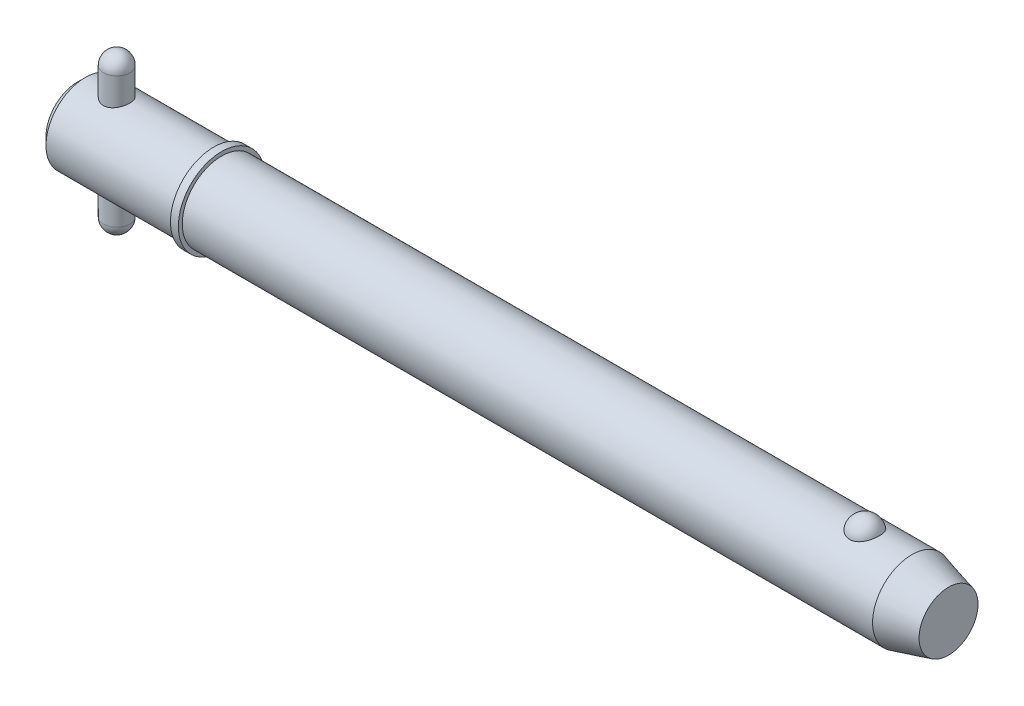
ISO-10303-21;
HEADER;
FILE_DESCRIPTION(('STEP AP214'),'2;1');
FILE_NAME('part.step','',(''),(''),'','','');
FILE_SCHEMA(('AUTOMOTIVE_DESIGN { 1 0 10303 214 1 1 1 1 }'));
ENDSEC;
DATA;
#1=APPLICATION_CONTEXT('core data for automotive mechanical design processes');
#2=APPLICATION_PROTOCOL_DEFINITION('international standard','automotive_design',2000,#1);
#3=PRODUCT_CONTEXT('',#1,'mechanical');
#4=PRODUCT('Part','Part','',(#3));
#5=PRODUCT_RELATED_PRODUCT_CATEGORY('part','',(#4));
#6=PRODUCT_DEFINITION_FORMATION('','',#4);
#7=PRODUCT_DEFINITION_CONTEXT('part definition',#1,'design');
#8=PRODUCT_DEFINITION('design','',#6,#7);
#9=PRODUCT_DEFINITION_SHAPE('','',#8);
#10=(LENGTH_UNIT() NAMED_UNIT(*) SI_UNIT(.MILLI.,.METRE.));
#11=(NAMED_UNIT(*) PLANE_ANGLE_UNIT() SI_UNIT($,.RADIAN.));
#12=(NAMED_UNIT(*) SI_UNIT($,.STERADIAN.) SOLID_ANGLE_UNIT());
#13=UNCERTAINTY_MEASURE_WITH_UNIT(LENGTH_MEASURE(1.E-05),#10,'distance_accuracy_value','');
#14=(GEOMETRIC_REPRESENTATION_CONTEXT(3) GLOBAL_UNCERTAINTY_ASSIGNED_CONTEXT((#13)) GLOBAL_UNIT_ASSIGNED_CONTEXT((#10,
#11,#12)) REPRESENTATION_CONTEXT('',''));
#15=CARTESIAN_POINT('',(0.,0.,0.));
#16=DIRECTION('',(0.,0.,1.));
#17=DIRECTION('',(1.,0.,0.));
#18=AXIS2_PLACEMENT_3D('',#15,#16,#17);
#19=CARTESIAN_POINT('',(9.525,19.05,0.));
#20=DIRECTION('',(0.,-1.,0.));
#21=DIRECTION('',(0.,0.,-1.));
#22=AXIS2_PLACEMENT_3D('',#19,#20,#21);
#23=CYLINDRICAL_SURFACE('',#22,3.175);
#24=CARTESIAN_POINT('',(9.525,-15.875,0.));
#25=DIRECTION('',(0.,-1.,0.));
#26=DIRECTION('',(0.,0.,-1.));
#27=AXIS2_PLACEMENT_3D('',#24,#25,#26);
#28=CIRCLE('',#27,3.175);
#29=CARTESIAN_POINT('',(9.525,-15.875,-3.175));
#30=VERTEX_POINT('',#29);
#31=EDGE_CURVE('P0_E10',#30,#30,#28,.F.);
#32=CARTESIAN_POINT('',(9.525,15.875,0.));
#33=DIRECTION('',(0.,-1.,0.));
#34=DIRECTION('',(0.,0.,-1.));
#35=AXIS2_PLACEMENT_3D('',#32,#33,#34);
#36=CIRCLE('',#35,3.175);
#37=CARTESIAN_POINT('',(9.525,15.875,-3.175));
#38=VERTEX_POINT('',#37);
#39=EDGE_CURVE('P0_E21',#38,#38,#36,.T.);
#40=CARTESIAN_POINT('',(9.525,-15.875,-3.175));
#41=CARTESIAN_POINT('',(9.525,-15.5442708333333,-3.175));
#42=CARTESIAN_POINT('',(9.525,-15.2135416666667,-3.175));
#43=CARTESIAN_POINT('',(9.525,-14.5520833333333,-3.175));
#44=CARTESIAN_POINT('',(9.525,-14.2213541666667,-3.175));
#45=CARTESIAN_POINT('',(9.525,-13.5598958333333,-3.175));
#46=CARTESIAN_POINT('',(9.525,-13.2291666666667,-3.175));
#47=CARTESIAN_POINT('',(9.525,-12.5677083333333,-3.175));
#48=CARTESIAN_POINT('',(9.525,-12.2369791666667,-3.175));
#49=CARTESIAN_POINT('',(9.525,-11.5755208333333,-3.175));
#50=CARTESIAN_POINT('',(9.525,-11.2447916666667,-3.175));
#51=CARTESIAN_POINT('',(9.525,-10.5833333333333,-3.175));
#52=CARTESIAN_POINT('',(9.525,-10.2526041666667,-3.175));
#53=CARTESIAN_POINT('',(9.525,-9.59114583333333,-3.175));
#54=CARTESIAN_POINT('',(9.525,-9.26041666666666,-3.175));
#55=CARTESIAN_POINT('',(9.525,-8.59895833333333,-3.175));
#56=CARTESIAN_POINT('',(9.525,-8.26822916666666,-3.175));
#57=CARTESIAN_POINT('',(9.525,-7.60677083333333,-3.175));
#58=CARTESIAN_POINT('',(9.525,-7.27604166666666,-3.175));
#59=CARTESIAN_POINT('',(9.525,-6.61458333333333,-3.175));
#60=CARTESIAN_POINT('',(9.525,-6.28385416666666,-3.175));
#61=CARTESIAN_POINT('',(9.525,-5.62239583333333,-3.175));
#62=CARTESIAN_POINT('',(9.525,-5.29166666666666,-3.175));
#63=CARTESIAN_POINT('',(9.525,-4.63020833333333,-3.175));
#64=CARTESIAN_POINT('',(9.525,-4.29947916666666,-3.175));
#65=CARTESIAN_POINT('',(9.525,-3.63802083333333,-3.175));
#66=CARTESIAN_POINT('',(9.525,-3.30729166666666,-3.175));
#67=CARTESIAN_POINT('',(9.525,-2.64583333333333,-3.175));
#68=CARTESIAN_POINT('',(9.525,-2.31510416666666,-3.175));
#69=CARTESIAN_POINT('',(9.525,-1.65364583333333,-3.175));
#70=CARTESIAN_POINT('',(9.525,-1.32291666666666,-3.175));
#71=CARTESIAN_POINT('',(9.525,-0.661458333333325,-3.175));
#72=CARTESIAN_POINT('',(9.525,-0.330729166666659,-3.175));
#73=CARTESIAN_POINT('',(9.525,0.330729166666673,-3.175));
#74=CARTESIAN_POINT('',(9.525,0.661458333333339,-3.175));
#75=CARTESIAN_POINT('',(9.525,1.32291666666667,-3.175));
#76=CARTESIAN_POINT('',(9.525,1.65364583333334,-3.175));
#77=CARTESIAN_POINT('',(9.525,2.31510416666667,-3.175));
#78=CARTESIAN_POINT('',(9.525,2.64583333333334,-3.175));
#79=CARTESIAN_POINT('',(9.525,3.30729166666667,-3.175));
#80=CARTESIAN_POINT('',(9.525,3.63802083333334,-3.175));
#81=CARTESIAN_POINT('',(9.525,4.29947916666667,-3.175));
#82=CARTESIAN_POINT('',(9.525,4.63020833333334,-3.175));
#83=CARTESIAN_POINT('',(9.525,5.29166666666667,-3.175));
#84=CARTESIAN_POINT('',(9.525,5.62239583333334,-3.175));
#85=CARTESIAN_POINT('',(9.525,6.28385416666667,-3.175));
#86=CARTESIAN_POINT('',(9.525,6.61458333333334,-3.175));
#87=CARTESIAN_POINT('',(9.525,7.27604166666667,-3.175));
#88=CARTESIAN_POINT('',(9.525,7.60677083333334,-3.175));
#89=CARTESIAN_POINT('',(9.525,8.26822916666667,-3.175));
#90=CARTESIAN_POINT('',(9.525,8.59895833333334,-3.175));
#91=CARTESIAN_POINT('',(9.525,9.26041666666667,-3.175));
#92=CARTESIAN_POINT('',(9.525,9.59114583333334,-3.175));
#93=CARTESIAN_POINT('',(9.525,10.2526041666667,-3.175));
#94=CARTESIAN_POINT('',(9.525,10.5833333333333,-3.175));
#95=CARTESIAN_POINT('',(9.525,11.2447916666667,-3.175));
#96=CARTESIAN_POINT('',(9.525,11.5755208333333,-3.175));
#97=CARTESIAN_POINT('',(9.525,12.2369791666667,-3.175));
#98=CARTESIAN_POINT('',(9.525,12.5677083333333,-3.175));
#99=CARTESIAN_POINT('',(9.525,13.2291666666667,-3.175));
#100=CARTESIAN_POINT('',(9.525,13.5598958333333,-3.175));
#101=CARTESIAN_POINT('',(9.525,14.2213541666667,-3.175));
#102=CARTESIAN_POINT('',(9.525,14.5520833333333,-3.175));
#103=CARTESIAN_POINT('',(9.525,15.2135416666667,-3.175));
#104=CARTESIAN_POINT('',(9.525,15.5442708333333,-3.175));
#105=CARTESIAN_POINT('',(9.525,15.875,-3.175));
#106=B_SPLINE_CURVE_WITH_KNOTS('',3,(#40,#41,#42,#43,#44,#45,#46,#47,#48,#49,#50,#51,#52,#53,
#54,#55,#56,#57,#58,#59,#60,#61,#62,#63,#64,#65,#66,#67,#68,#69,#70,#71,#72,#73,#74,#75,#76,#77,
#78,#79,#80,#81,#82,#83,#84,#85,#86,#87,#88,#89,#90,#91,#92,#93,#94,#95,#96,#97,#98,#99,#100,
#101,#102,#103,#104,#105),.UNSPECIFIED.,.F.,.F.,(4,2,2,2,2,2,2,2,2,2,2,2,2,2,2,2,2,2,2,2,2,2,2,
2,2,2,2,2,2,2,2,2,4),(0.,0.992187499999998,1.984375,2.9765625,3.96875,4.96093749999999,5.953125,
6.9453125,7.9375,8.92968749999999,9.921875,10.9140625,11.90625,12.8984375,13.890625,14.8828125,
15.875,16.8671875,17.859375,18.8515625,19.84375,20.8359375,21.828125,22.8203125,23.8125,
24.8046875,25.796875,26.7890625,27.78125,28.7734375,29.765625,30.7578125,31.75),.UNSPECIFIED.);
#107=EDGE_CURVE('P0_BSEAM14',#30,#38,#106,.T.);
#108=ORIENTED_EDGE('',*,*,#31,.T.);
#109=ORIENTED_EDGE('',*,*,#39,.T.);
#110=ORIENTED_EDGE('',*,*,#107,.T.);
#111=ORIENTED_EDGE('',*,*,#107,.F.);
#112=EDGE_LOOP('',(#108,#110,#109,#111));
#113=FACE_BOUND('',#112,.T.);
#114=ADVANCED_FACE('P0_F14',(#113),#23,.T.);
#115=CARTESIAN_POINT('',(9.525,-15.875,0.));
#116=DIRECTION('',(0.,0.,1.));
#117=DIRECTION('',(1.,0.,0.));
#118=AXIS2_PLACEMENT_3D('',#115,#116,#117);
#119=SPHERICAL_SURFACE('',#118,3.175);
#120=CARTESIAN_POINT('',(9.525,-15.875,0.));
#121=DIRECTION('',(0.,-1.,0.));
#122=DIRECTION('',(0.,0.,-1.));
#123=AXIS2_PLACEMENT_3D('',#120,#121,#122);
#124=SPHERICAL_SURFACE('',#123,3.175);
#125=ORIENTED_EDGE('',*,*,#31,.F.);
#126=EDGE_LOOP('',(#125));
#127=FACE_BOUND('',#126,.T.);
#128=ADVANCED_FACE('P0_F29',(#127),#124,.T.);
#129=CARTESIAN_POINT('',(9.525,15.875,0.));
#130=DIRECTION('',(0.,0.,1.));
#131=DIRECTION('',(1.,0.,0.));
#132=AXIS2_PLACEMENT_3D('',#129,#130,#131);
#133=SPHERICAL_SURFACE('',#132,3.175);
#134=CARTESIAN_POINT('',(9.525,15.875,0.));
#135=DIRECTION('',(0.,-1.,0.));
#136=DIRECTION('',(0.,0.,-1.));
#137=AXIS2_PLACEMENT_3D('',#134,#135,#136);
#138=SPHERICAL_SURFACE('',#137,3.175);
#139=ORIENTED_EDGE('',*,*,#39,.F.);
#140=EDGE_LOOP('',(#139));
#141=FACE_BOUND('',#140,.T.);
#142=ADVANCED_FACE('P0_F16',(#141),#138,.T.);
#143=CLOSED_SHELL('',(#114,#128,#142));
#144=MANIFOLD_SOLID_BREP('P0_B1',#143);
#145=CARTESIAN_POINT('',(0.,0.,0.));
#146=DIRECTION('',(1.,0.,0.));
#147=DIRECTION('',(0.,0.,-1.));
#148=AXIS2_PLACEMENT_3D('',#145,#146,#147);
#149=CYLINDRICAL_SURFACE('',#148,9.525);
#150=CARTESIAN_POINT('',(202.243054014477,0.,0.));
#151=DIRECTION('',(1.,0.,0.));
#152=DIRECTION('',(0.,0.,-1.));
#153=AXIS2_PLACEMENT_3D('',#150,#151,#152);
#154=CIRCLE('',#153,9.525);
#155=CARTESIAN_POINT('',(202.243054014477,0.,-9.525));
#156=VERTEX_POINT('',#155);
#157=EDGE_CURVE('P1_E81',#156,#156,#154,.T.);
#158=ORIENTED_EDGE('',*,*,#157,.F.);
#159=EDGE_LOOP('',(#158));
#160=FACE_BOUND('',#159,.T.);
#161=CARTESIAN_POINT('',(34.93,0.,0.));
#162=DIRECTION('',(1.,0.,0.));
#163=DIRECTION('',(0.,0.,-1.));
#164=AXIS2_PLACEMENT_3D('',#161,#162,#163);
#165=CIRCLE('',#164,9.525);
#166=CARTESIAN_POINT('',(34.93,0.,-9.525));
#167=VERTEX_POINT('',#166);
#168=EDGE_CURVE('P1_E85',#167,#167,#165,.T.);
#169=ORIENTED_EDGE('',*,*,#168,.T.);
#170=EDGE_LOOP('',(#169));
#171=FACE_BOUND('',#170,.T.);
#172=CARTESIAN_POINT('',(190.845757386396,8.80405803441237,3.63513233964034));
#173=CARTESIAN_POINT('',(190.751676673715,8.80405953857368,3.63513053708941));
#174=CARTESIAN_POINT('',(190.657561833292,8.80561325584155,3.63137461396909));
#175=CARTESIAN_POINT('',(190.470012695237,8.81177748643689,3.61638665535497));
#176=CARTESIAN_POINT('',(190.376578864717,8.81638992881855,3.60514990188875));
#177=CARTESIAN_POINT('',(190.097945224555,8.83467114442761,3.56024627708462));
#178=CARTESIAN_POINT('',(189.914691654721,8.85278327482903,3.51538626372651));
#179=CARTESIAN_POINT('',(189.559509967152,8.89871214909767,3.39742145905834));
#180=CARTESIAN_POINT('',(189.387553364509,8.92650327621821,3.32439116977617));
#181=CARTESIAN_POINT('',(189.058707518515,8.98874819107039,3.15220244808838));
#182=CARTESIAN_POINT('',(188.901811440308,9.02319893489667,3.05305594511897));
#183=CARTESIAN_POINT('',(188.602214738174,9.09629186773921,2.82797815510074));
#184=CARTESIAN_POINT('',(188.460060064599,9.13502685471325,2.70135138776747));
#185=CARTESIAN_POINT('',(188.198299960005,9.21186572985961,2.42641932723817));
#186=CARTESIAN_POINT('',(188.078701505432,9.24996941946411,2.2781073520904));
#187=CARTESIAN_POINT('',(187.859645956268,9.32341082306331,1.95652290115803));
#188=CARTESIAN_POINT('',(187.761317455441,9.35855090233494,1.78243511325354));
#189=CARTESIAN_POINT('',(187.593819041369,9.42045142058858,1.41937246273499));
#190=CARTESIAN_POINT('',(187.524651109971,9.44721128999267,1.23039658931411));
#191=CARTESIAN_POINT('',(187.416199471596,9.48990641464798,0.840370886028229));
#192=CARTESIAN_POINT('',(187.377288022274,9.50570658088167,0.639202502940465));
#193=CARTESIAN_POINT('',(187.331555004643,9.52433146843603,0.232664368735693));
#194=CARTESIAN_POINT('',(187.324732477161,9.52715657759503,0.0272947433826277));
#195=CARTESIAN_POINT('',(187.343255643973,9.51956918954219,-0.380478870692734));
#196=CARTESIAN_POINT('',(187.368405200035,9.50923740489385,-0.582893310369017));
#197=CARTESIAN_POINT('',(187.45002537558,9.47651897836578,-0.980293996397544));
#198=CARTESIAN_POINT('',(187.506496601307,9.45413210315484,-1.17528009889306));
#199=CARTESIAN_POINT('',(187.649719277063,9.39954044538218,-1.55263697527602));
#200=CARTESIAN_POINT('',(187.736512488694,9.36732213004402,-1.73498993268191));
#201=CARTESIAN_POINT('',(187.938610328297,9.29640700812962,-2.08177763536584));
#202=CARTESIAN_POINT('',(188.053917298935,9.25770966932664,-2.24621090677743));
#203=CARTESIAN_POINT('',(188.311264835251,9.17775604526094,-2.5533833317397));
#204=CARTESIAN_POINT('',(188.453434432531,9.136488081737,-2.696011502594));
#205=CARTESIAN_POINT('',(188.76089985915,9.05620497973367,-2.95451229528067));
#206=CARTESIAN_POINT('',(188.926193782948,9.01718965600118,-3.07038711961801));
#207=CARTESIAN_POINT('',(189.272052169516,8.94680019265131,-3.26976836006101));
#208=CARTESIAN_POINT('',(189.452227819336,8.91528408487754,-3.35389750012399));
#209=CARTESIAN_POINT('',(189.825651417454,8.86272514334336,-3.49043503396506));
#210=CARTESIAN_POINT('',(190.018894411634,8.84167836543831,-3.54285537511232));
#211=CARTESIAN_POINT('',(190.402503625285,8.81348056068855,-3.61241306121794));
#212=CARTESIAN_POINT('',(190.592525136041,8.80568348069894,-3.6311933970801));
#213=CARTESIAN_POINT('',(190.973190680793,8.80289410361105,-3.63795342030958));
#214=CARTESIAN_POINT('',(191.163834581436,8.80789922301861,-3.62593932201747));
#215=CARTESIAN_POINT('',(191.534007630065,8.82974915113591,-3.57238430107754));
#216=CARTESIAN_POINT('',(191.713697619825,8.84621463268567,-3.53178890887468));
#217=CARTESIAN_POINT('',(192.063422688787,8.88875330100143,-3.42331083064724));
#218=CARTESIAN_POINT('',(192.233456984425,8.91482726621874,-3.35542593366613));
#219=CARTESIAN_POINT('',(192.563237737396,8.97448239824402,-3.19248225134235));
#220=CARTESIAN_POINT('',(192.722680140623,9.00821446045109,-3.0968647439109));
#221=CARTESIAN_POINT('',(193.023513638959,9.07935398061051,-2.88162736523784));
#222=CARTESIAN_POINT('',(193.164900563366,9.11676228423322,-2.76200196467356));
#223=CARTESIAN_POINT('',(193.43331931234,9.19347419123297,-2.49516285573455));
#224=CARTESIAN_POINT('',(193.559275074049,9.23277872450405,-2.34686614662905));
#225=CARTESIAN_POINT('',(193.785522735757,9.3073761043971,-2.03093683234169));
#226=CARTESIAN_POINT('',(193.88581004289,9.34266823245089,-1.86330077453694));
#227=CARTESIAN_POINT('',(194.061514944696,9.40674710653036,-1.50744893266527));
#228=CARTESIAN_POINT('',(194.136041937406,9.43529176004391,-1.31874876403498));
#229=CARTESIAN_POINT('',(194.25416505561,9.48144132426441,-0.930631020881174));
#230=CARTESIAN_POINT('',(194.297760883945,9.49904612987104,-0.731213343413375));
#231=CARTESIAN_POINT('',(194.353158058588,9.5215314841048,-0.327147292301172));
#232=CARTESIAN_POINT('',(194.364935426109,9.52640243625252,-0.122495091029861));
#233=CARTESIAN_POINT('',(194.356382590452,9.5228957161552,0.28601848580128));
#234=CARTESIAN_POINT('',(194.33605305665,9.5145183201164,0.489879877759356));
#235=CARTESIAN_POINT('',(194.263884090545,9.48544083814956,0.88999431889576));
#236=CARTESIAN_POINT('',(194.212199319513,9.46480124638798,1.08627971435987));
#237=CARTESIAN_POINT('',(194.078491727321,9.4133389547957,1.46682086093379));
#238=CARTESIAN_POINT('',(193.996466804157,9.38251554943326,1.65107577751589));
#239=CARTESIAN_POINT('',(193.80319292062,9.31365636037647,2.00346348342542));
#240=CARTESIAN_POINT('',(193.691783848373,9.27558138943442,2.17150083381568));
#241=CARTESIAN_POINT('',(193.442294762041,9.19638714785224,2.48563115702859));
#242=CARTESIAN_POINT('',(193.304216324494,9.15526805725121,2.63172542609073));
#243=CARTESIAN_POINT('',(193.004843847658,9.07465393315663,2.89750997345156));
#244=CARTESIAN_POINT('',(192.843610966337,9.03515496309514,3.01726776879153));
#245=CARTESIAN_POINT('',(192.501613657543,8.96227564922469,3.22732920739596));
#246=CARTESIAN_POINT('',(192.320841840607,8.92889763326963,3.31762165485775));
#247=CARTESIAN_POINT('',(191.951445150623,8.8734538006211,3.46314419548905));
#248=CARTESIAN_POINT('',(191.76332371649,8.85102983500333,3.51950082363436));
#249=CARTESIAN_POINT('',(191.47578699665,8.8266696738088,3.57993683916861));
#250=CARTESIAN_POINT('',(191.379133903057,8.82009725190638,3.5960621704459));
#251=CARTESIAN_POINT('',(191.184677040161,8.81020897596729,3.62022512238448));
#252=CARTESIAN_POINT('',(191.086874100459,8.80689090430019,3.62826825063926));
#253=CARTESIAN_POINT('',(190.941224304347,8.80445615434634,3.63416760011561));
#254=CARTESIAN_POINT('',(190.893495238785,8.80405727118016,3.63513325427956));
#255=CARTESIAN_POINT('',(190.845757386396,8.80405803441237,3.63513233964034));
#256=B_SPLINE_CURVE_WITH_KNOTS('',3,(#172,#173,#174,#175,#176,#177,#178,#179,#180,#181,#182,
#183,#184,#185,#186,#187,#188,#189,#190,#191,#192,#193,#194,#195,#196,#197,#198,#199,#200,#201,
#202,#203,#204,#205,#206,#207,#208,#209,#210,#211,#212,#213,#214,#215,#216,#217,#218,#219,#220,
#221,#222,#223,#224,#225,#226,#227,#228,#229,#230,#231,#232,#233,#234,#235,#236,#237,#238,#239,
#240,#241,#242,#243,#244,#245,#246,#247,#248,#249,#250,#251,#252,#253,#254,#255),.UNSPECIFIED.,
.T.,.F.,(4,2,2,2,2,2,2,2,2,2,2,2,2,2,2,2,2,2,2,2,2,2,2,2,2,2,2,2,2,2,2,2,2,2,2,2,2,2,2,2,2,4),
(0.,0.282202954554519,0.564584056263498,1.13017050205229,1.69427128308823,2.25811483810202,
2.83836627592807,3.41879688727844,4.02497117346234,4.63118665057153,5.24474754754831,
5.85829010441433,6.46808687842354,7.07789545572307,7.68854723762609,8.299249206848,
8.91296283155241,9.52662591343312,10.1275338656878,10.7282152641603,11.2986646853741,
11.8689989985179,12.4213015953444,12.973648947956,13.5380053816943,14.1024919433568,
14.695298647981,15.2882113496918,15.8999469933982,16.5116885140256,17.1238909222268,
17.7360805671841,18.3452748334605,18.9545113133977,19.567138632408,20.179729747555,
20.7907316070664,21.4019653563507,21.9915938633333,22.2859053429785,22.5800161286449,
22.7232098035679),.UNSPECIFIED.);
#257=CARTESIAN_POINT('',(190.845757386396,8.80405803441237,3.63513233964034));
#258=VERTEX_POINT('',#257);
#259=EDGE_CURVE('P1_E35',#258,#258,#256,.T.);
#260=ORIENTED_EDGE('',*,*,#259,.T.);
#261=EDGE_LOOP('',(#260));
#262=FACE_BOUND('',#261,.T.);
#263=ADVANCED_FACE('P1_F13',(#160,#171,#262),#149,.T.);
#264=CARTESIAN_POINT('',(0.,0.,0.));
#265=DIRECTION('',(-1.,0.,0.));
#266=DIRECTION('',(0.,0.,1.));
#267=AXIS2_PLACEMENT_3D('',#264,#265,#266);
#268=PLANE('',#267);
#269=CARTESIAN_POINT('',(0.,0.,0.));
#270=DIRECTION('',(1.,0.,0.));
#271=DIRECTION('',(0.,0.,-1.));
#272=AXIS2_PLACEMENT_3D('',#269,#270,#271);
#273=CIRCLE('',#272,7.62);
#274=CARTESIAN_POINT('',(0.,0.,-7.62));
#275=VERTEX_POINT('',#274);
#276=EDGE_CURVE('P1_E9',#275,#275,#273,.T.);
#277=ORIENTED_EDGE('',*,*,#276,.F.);
#278=EDGE_LOOP('',(#277));
#279=FACE_BOUND('',#278,.T.);
#280=ADVANCED_FACE('P1_F15',(#279),#268,.T.);
#281=CARTESIAN_POINT('',(1.90499999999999,0.,0.));
#282=DIRECTION('',(1.,0.,0.));
#283=DIRECTION('',(0.,0.,-1.));
#284=AXIS2_PLACEMENT_3D('',#281,#282,#283);
#285=CONICAL_SURFACE('',#284,9.525,0.785398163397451);
#286=ORIENTED_EDGE('',*,*,#276,.T.);
#287=EDGE_LOOP('',(#286));
#288=FACE_BOUND('',#287,.T.);
#289=CARTESIAN_POINT('',(1.90499999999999,0.,0.));
#290=DIRECTION('',(1.,0.,0.));
#291=DIRECTION('',(0.,0.,-1.));
#292=AXIS2_PLACEMENT_3D('',#289,#290,#291);
#293=CIRCLE('',#292,9.525);
#294=CARTESIAN_POINT('',(1.90499999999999,0.,-9.525));
#295=VERTEX_POINT('',#294);
#296=EDGE_CURVE('P1_E26',#295,#295,#293,.T.);
#297=ORIENTED_EDGE('',*,*,#296,.F.);
#298=EDGE_LOOP('',(#297));
#299=FACE_BOUND('',#298,.T.);
#300=ADVANCED_FACE('P1_F77',(#288,#299),#285,.T.);
#301=CARTESIAN_POINT('',(0.,0.,0.));
#302=DIRECTION('',(1.,0.,0.));
#303=DIRECTION('',(0.,0.,-1.));
#304=AXIS2_PLACEMENT_3D('',#301,#302,#303);
#305=CYLINDRICAL_SURFACE('',#304,9.525);
#306=CARTESIAN_POINT('',(9.525,-8.98025612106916,3.175));
#307=CARTESIAN_POINT('',(9.35206354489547,-8.98025555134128,3.17500081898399));
#308=CARTESIAN_POINT('',(9.17913201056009,-8.98530617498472,3.16082293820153));
#309=CARTESIAN_POINT('',(8.83839221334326,-9.00485797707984,3.10467734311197));
#310=CARTESIAN_POINT('',(8.67058479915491,-9.0193607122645,3.06270505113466));
#311=CARTESIAN_POINT('',(8.34508461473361,-9.05599546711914,2.95260866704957));
#312=CARTESIAN_POINT('',(8.18737272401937,-9.07811252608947,2.88453582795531));
#313=CARTESIAN_POINT('',(7.88555684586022,-9.12746212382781,2.72434567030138));
#314=CARTESIAN_POINT('',(7.74145587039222,-9.1546957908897,2.63222304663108));
#315=CARTESIAN_POINT('',(7.46531411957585,-9.21240503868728,2.42268738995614));
#316=CARTESIAN_POINT('',(7.33388351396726,-9.24296141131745,2.30449228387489));
#317=CARTESIAN_POINT('',(7.09229340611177,-9.30319020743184,2.0478358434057));
#318=CARTESIAN_POINT('',(6.98213731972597,-9.33286248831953,1.90937126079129));
#319=CARTESIAN_POINT('',(6.78345450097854,-9.38891527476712,1.61164431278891));
#320=CARTESIAN_POINT('',(6.69556709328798,-9.41518969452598,1.45193356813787));
#321=CARTESIAN_POINT('',(6.54814671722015,-9.46053437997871,1.11896913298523));
#322=CARTESIAN_POINT('',(6.48860610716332,-9.47960658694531,0.945719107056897));
#323=CARTESIAN_POINT('',(6.40163866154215,-9.50782564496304,0.596991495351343));
#324=CARTESIAN_POINT('',(6.373166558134,-9.5172947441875,0.421801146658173));
#325=CARTESIAN_POINT('',(6.3458207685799,-9.52638456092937,0.068890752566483));
#326=CARTESIAN_POINT('',(6.34693945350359,-9.52600781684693,-0.108828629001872));
#327=CARTESIAN_POINT('',(6.37808050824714,-9.51566675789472,-0.454353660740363));
#328=CARTESIAN_POINT('',(6.4069675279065,-9.50607905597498,-0.622274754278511));
#329=CARTESIAN_POINT('',(6.490947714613,-9.47886621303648,-0.950732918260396));
#330=CARTESIAN_POINT('',(6.54604265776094,-9.46124052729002,-1.11126948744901));
#331=CARTESIAN_POINT('',(6.68153768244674,-9.41945253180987,-1.42288410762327));
#332=CARTESIAN_POINT('',(6.76226085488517,-9.3952073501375,-1.57381010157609));
#333=CARTESIAN_POINT('',(6.94645456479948,-9.34270397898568,-1.86030973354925));
#334=CARTESIAN_POINT('',(7.04993142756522,-9.31444467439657,-1.99587908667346));
#335=CARTESIAN_POINT('',(7.28241619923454,-9.25532159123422,-2.2545702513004));
#336=CARTESIAN_POINT('',(7.4123967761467,-9.22439783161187,-2.37680549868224));
#337=CARTESIAN_POINT('',(7.69127470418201,-9.1645528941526,-2.5980302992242));
#338=CARTESIAN_POINT('',(7.84017496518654,-9.13563202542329,-2.6970162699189));
#339=CARTESIAN_POINT('',(8.15547526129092,-9.08273917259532,-2.87016016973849));
#340=CARTESIAN_POINT('',(8.32209451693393,-9.05884361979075,-2.94394402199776));
#341=CARTESIAN_POINT('',(8.66638917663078,-9.01959241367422,-3.06210713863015));
#342=CARTESIAN_POINT('',(8.84405991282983,-9.00423318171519,-3.10649872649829));
#343=CARTESIAN_POINT('',(9.19682677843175,-8.98460345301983,-3.16281207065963));
#344=CARTESIAN_POINT('',(9.37167742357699,-8.9798639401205,-3.17610837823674));
#345=CARTESIAN_POINT('',(9.72113927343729,-8.9806993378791,-3.17374726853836));
#346=CARTESIAN_POINT('',(9.89575051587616,-8.98627237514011,-3.15809511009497));
#347=CARTESIAN_POINT('',(10.2335233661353,-9.00663737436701,-3.09951644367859));
#348=CARTESIAN_POINT('',(10.3968722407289,-9.02110608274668,-3.05754530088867));
#349=CARTESIAN_POINT('',(10.7141759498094,-9.05727657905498,-2.94866651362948));
#350=CARTESIAN_POINT('',(10.8681291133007,-9.07897964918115,-2.88175444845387));
#351=CARTESIAN_POINT('',(11.1676828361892,-9.12802586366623,-2.72248103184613));
#352=CARTESIAN_POINT('',(11.3128635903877,-9.1555260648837,-2.62937980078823));
#353=CARTESIAN_POINT('',(11.5860387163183,-9.21276315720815,-2.42120937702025));
#354=CARTESIAN_POINT('',(11.7140280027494,-9.24250070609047,-2.30613370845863));
#355=CARTESIAN_POINT('',(11.9555513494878,-9.30259247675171,-2.05070616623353));
#356=CARTESIAN_POINT('',(12.0680936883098,-9.33290753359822,-1.90940458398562));
#357=CARTESIAN_POINT('',(12.267933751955,-9.3893275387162,-1.60917665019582));
#358=CARTESIAN_POINT('',(12.3552323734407,-9.41543263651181,-1.45025092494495));
#359=CARTESIAN_POINT('',(12.5013088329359,-9.46036988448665,-1.12007606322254));
#360=CARTESIAN_POINT('',(12.5602723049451,-9.47924920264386,-0.9489158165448));
#361=CARTESIAN_POINT('',(12.6483355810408,-9.50781089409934,-0.598355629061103));
#362=CARTESIAN_POINT('',(12.6774461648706,-9.5174965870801,-0.4189586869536));
#363=CARTESIAN_POINT('',(12.7040070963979,-9.52632915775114,-0.066088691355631));
#364=CARTESIAN_POINT('',(12.7028811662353,-9.52594996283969,0.107266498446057));
#365=CARTESIAN_POINT('',(12.6725130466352,-9.51586223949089,0.451202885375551));
#366=CARTESIAN_POINT('',(12.643273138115,-9.50615446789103,0.621784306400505));
#367=CARTESIAN_POINT('',(12.5584514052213,-9.47867404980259,0.952633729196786));
#368=CARTESIAN_POINT('',(12.5032953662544,-9.46103195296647,1.1130225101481));
#369=CARTESIAN_POINT('',(12.3686013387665,-9.41949985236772,1.42233126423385));
#370=CARTESIAN_POINT('',(12.2890589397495,-9.39560871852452,1.57124915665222));
#371=CARTESIAN_POINT('',(12.1044667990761,-9.34294133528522,1.85938800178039));
#372=CARTESIAN_POINT('',(11.9985831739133,-9.31401720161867,1.9980473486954));
#373=CARTESIAN_POINT('',(11.7657327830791,-9.25490239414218,2.25609475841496));
#374=CARTESIAN_POINT('',(11.6387592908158,-9.22471131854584,2.37547664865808));
#375=CARTESIAN_POINT('',(11.3613902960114,-9.16505913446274,2.59633024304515));
#376=CARTESIAN_POINT('',(11.2102725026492,-9.13567286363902,2.69691791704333));
#377=CARTESIAN_POINT('',(10.8923631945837,-9.08241113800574,2.87119803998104));
#378=CARTESIAN_POINT('',(10.7255757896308,-9.05853424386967,2.94489751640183));
#379=CARTESIAN_POINT('',(10.3887212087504,-9.02021736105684,3.06020415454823));
#380=CARTESIAN_POINT('',(10.219143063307,-9.00539959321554,3.10311136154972));
#381=CARTESIAN_POINT('',(9.87470703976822,-8.98542092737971,3.16050396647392));
#382=CARTESIAN_POINT('',(9.699851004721,-8.98025669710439,3.17499917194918));
#383=CARTESIAN_POINT('',(9.525,-8.98025612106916,3.175));
#384=B_SPLINE_CURVE_WITH_KNOTS('',3,(#306,#307,#308,#309,#310,#311,#312,#313,#314,#315,#316,
#317,#318,#319,#320,#321,#322,#323,#324,#325,#326,#327,#328,#329,#330,#331,#332,#333,#334,#335,
#336,#337,#338,#339,#340,#341,#342,#343,#344,#345,#346,#347,#348,#349,#350,#351,#352,#353,#354,
#355,#356,#357,#358,#359,#360,#361,#362,#363,#364,#365,#366,#367,#368,#369,#370,#371,#372,#373,
#374,#375,#376,#377,#378,#379,#380,#381,#382,#383),.UNSPECIFIED.,.T.,.F.,(4,2,2,2,2,2,2,2,2,2,2,
2,2,2,2,2,2,2,2,2,2,2,2,2,2,2,2,2,2,2,2,2,2,2,2,2,2,2,4),(0.,0.518161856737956,1.03640907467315,
1.55364379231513,2.07099270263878,2.60671746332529,3.14252816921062,3.69231882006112,
4.24196117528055,4.77247962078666,5.30286129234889,5.81244090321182,6.32205505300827,
6.83836754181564,7.3548237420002,7.89559553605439,8.43645060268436,8.98501631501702,
9.53335188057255,10.056948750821,10.5804505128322,11.0859695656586,11.5915782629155,
12.1132237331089,12.6350231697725,13.1819271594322,13.7288117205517,14.2720628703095,
14.815117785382,15.3326491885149,15.8501386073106,16.3594083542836,16.868770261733,
17.3969527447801,17.925304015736,18.4743376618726,19.023227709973,19.5473069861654,
20.0712053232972),.UNSPECIFIED.);
#385=CARTESIAN_POINT('',(9.525,-8.98025612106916,3.175));
#386=VERTEX_POINT('',#385);
#387=EDGE_CURVE('P1_E17',#386,#386,#384,.T.);
#388=ORIENTED_EDGE('',*,*,#387,.F.);
#389=EDGE_LOOP('',(#388));
#390=FACE_BOUND('',#389,.T.);
#391=CARTESIAN_POINT('',(9.525,8.98025612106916,3.175));
#392=CARTESIAN_POINT('',(9.69793645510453,8.98025555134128,3.17500081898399));
#393=CARTESIAN_POINT('',(9.87086798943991,8.98530617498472,3.16082293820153));
#394=CARTESIAN_POINT('',(10.2116077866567,9.00485797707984,3.10467734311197));
#395=CARTESIAN_POINT('',(10.3794152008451,9.0193607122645,3.06270505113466));
#396=CARTESIAN_POINT('',(10.7049153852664,9.05599546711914,2.95260866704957));
#397=CARTESIAN_POINT('',(10.8626272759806,9.07811252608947,2.88453582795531));
#398=CARTESIAN_POINT('',(11.1644431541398,9.12746212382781,2.72434567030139));
#399=CARTESIAN_POINT('',(11.3085441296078,9.15469579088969,2.63222304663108));
#400=CARTESIAN_POINT('',(11.5846858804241,9.21240503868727,2.42268738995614));
#401=CARTESIAN_POINT('',(11.7161164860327,9.24296141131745,2.30449228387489));
#402=CARTESIAN_POINT('',(11.9577065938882,9.30319020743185,2.0478358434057));
#403=CARTESIAN_POINT('',(12.067862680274,9.33286248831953,1.90937126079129));
#404=CARTESIAN_POINT('',(12.2665454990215,9.38891527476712,1.61164431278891));
#405=CARTESIAN_POINT('',(12.354432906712,9.41518969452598,1.45193356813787));
#406=CARTESIAN_POINT('',(12.5018532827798,9.46053437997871,1.11896913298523));
#407=CARTESIAN_POINT('',(12.5613938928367,9.47960658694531,0.945719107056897));
#408=CARTESIAN_POINT('',(12.6483613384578,9.50782564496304,0.596991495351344));
#409=CARTESIAN_POINT('',(12.676833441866,9.5172947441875,0.421801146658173));
#410=CARTESIAN_POINT('',(12.7041792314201,9.52638456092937,0.0688907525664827));
#411=CARTESIAN_POINT('',(12.7030605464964,9.52600781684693,-0.108828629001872));
#412=CARTESIAN_POINT('',(12.6719194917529,9.51566675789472,-0.454353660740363));
#413=CARTESIAN_POINT('',(12.6430324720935,9.50607905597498,-0.622274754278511));
#414=CARTESIAN_POINT('',(12.559052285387,9.47886621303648,-0.950732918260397));
#415=CARTESIAN_POINT('',(12.5039573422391,9.46124052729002,-1.11126948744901));
#416=CARTESIAN_POINT('',(12.3684623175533,9.41945253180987,-1.42288410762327));
#417=CARTESIAN_POINT('',(12.2877391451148,9.3952073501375,-1.57381010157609));
#418=CARTESIAN_POINT('',(12.1035454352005,9.34270397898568,-1.86030973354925));
#419=CARTESIAN_POINT('',(12.0000685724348,9.31444467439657,-1.99587908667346));
#420=CARTESIAN_POINT('',(11.7675838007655,9.25532159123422,-2.2545702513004));
#421=CARTESIAN_POINT('',(11.6376032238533,9.22439783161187,-2.37680549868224));
#422=CARTESIAN_POINT('',(11.358725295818,9.1645528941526,-2.5980302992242));
#423=CARTESIAN_POINT('',(11.2098250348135,9.13563202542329,-2.6970162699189));
#424=CARTESIAN_POINT('',(10.8945247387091,9.08273917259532,-2.87016016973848));
#425=CARTESIAN_POINT('',(10.7279054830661,9.05884361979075,-2.94394402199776));
#426=CARTESIAN_POINT('',(10.3836108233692,9.01959241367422,-3.06210713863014));
#427=CARTESIAN_POINT('',(10.2059400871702,9.00423318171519,-3.10649872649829));
#428=CARTESIAN_POINT('',(9.85317322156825,8.98460345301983,-3.16281207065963));
#429=CARTESIAN_POINT('',(9.67832257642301,8.9798639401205,-3.17610837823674));
#430=CARTESIAN_POINT('',(9.32886072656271,8.9806993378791,-3.17374726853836));
#431=CARTESIAN_POINT('',(9.15424948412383,8.98627237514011,-3.15809511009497));
#432=CARTESIAN_POINT('',(8.81647663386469,9.00663737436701,-3.09951644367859));
#433=CARTESIAN_POINT('',(8.65312775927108,9.02110608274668,-3.05754530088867));
#434=CARTESIAN_POINT('',(8.33582405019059,9.05727657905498,-2.94866651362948));
#435=CARTESIAN_POINT('',(8.18187088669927,9.07897964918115,-2.88175444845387));
#436=CARTESIAN_POINT('',(7.88231716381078,9.12802586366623,-2.72248103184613));
#437=CARTESIAN_POINT('',(7.73713640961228,9.1555260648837,-2.62937980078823));
#438=CARTESIAN_POINT('',(7.46396128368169,9.21276315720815,-2.42120937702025));
#439=CARTESIAN_POINT('',(7.33597199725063,9.24250070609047,-2.30613370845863));
#440=CARTESIAN_POINT('',(7.09444865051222,9.30259247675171,-2.05070616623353));
#441=CARTESIAN_POINT('',(6.98190631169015,9.33290753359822,-1.90940458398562));
#442=CARTESIAN_POINT('',(6.78206624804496,9.3893275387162,-1.60917665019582));
#443=CARTESIAN_POINT('',(6.6947676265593,9.41543263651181,-1.45025092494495));
#444=CARTESIAN_POINT('',(6.54869116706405,9.46036988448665,-1.12007606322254));
#445=CARTESIAN_POINT('',(6.48972769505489,9.47924920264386,-0.948915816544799));
#446=CARTESIAN_POINT('',(6.40166441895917,9.50781089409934,-0.598355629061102));
#447=CARTESIAN_POINT('',(6.3725538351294,9.5174965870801,-0.418958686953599));
#448=CARTESIAN_POINT('',(6.34599290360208,9.52632915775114,-0.0660886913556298));
#449=CARTESIAN_POINT('',(6.3471188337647,9.52594996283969,0.107266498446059));
#450=CARTESIAN_POINT('',(6.37748695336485,9.51586223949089,0.451202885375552));
#451=CARTESIAN_POINT('',(6.40672686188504,9.50615446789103,0.621784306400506));
#452=CARTESIAN_POINT('',(6.49154859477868,9.47867404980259,0.952633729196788));
#453=CARTESIAN_POINT('',(6.54670463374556,9.46103195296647,1.11302251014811));
#454=CARTESIAN_POINT('',(6.68139866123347,9.41949985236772,1.42233126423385));
#455=CARTESIAN_POINT('',(6.76094106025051,9.39560871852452,1.57124915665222));
#456=CARTESIAN_POINT('',(6.94553320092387,9.34294133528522,1.85938800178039));
#457=CARTESIAN_POINT('',(7.05141682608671,9.31401720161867,1.9980473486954));
#458=CARTESIAN_POINT('',(7.28426721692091,9.25490239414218,2.25609475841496));
#459=CARTESIAN_POINT('',(7.41124070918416,9.22471131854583,2.37547664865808));
#460=CARTESIAN_POINT('',(7.68860970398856,9.16505913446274,2.59633024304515));
#461=CARTESIAN_POINT('',(7.83972749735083,9.13567286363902,2.69691791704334));
#462=CARTESIAN_POINT('',(8.15763680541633,9.08241113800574,2.87119803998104));
#463=CARTESIAN_POINT('',(8.32442421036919,9.05853424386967,2.94489751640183));
#464=CARTESIAN_POINT('',(8.66127879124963,9.02021736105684,3.06020415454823));
#465=CARTESIAN_POINT('',(8.83085693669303,9.00539959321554,3.10311136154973));
#466=CARTESIAN_POINT('',(9.17529296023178,8.98542092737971,3.16050396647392));
#467=CARTESIAN_POINT('',(9.350148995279,8.98025669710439,3.17499917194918));
#468=CARTESIAN_POINT('',(9.525,8.98025612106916,3.175));
#469=B_SPLINE_CURVE_WITH_KNOTS('',3,(#391,#392,#393,#394,#395,#396,#397,#398,#399,#400,#401,
#402,#403,#404,#405,#406,#407,#408,#409,#410,#411,#412,#413,#414,#415,#416,#417,#418,#419,#420,
#421,#422,#423,#424,#425,#426,#427,#428,#429,#430,#431,#432,#433,#434,#435,#436,#437,#438,#439,
#440,#441,#442,#443,#444,#445,#446,#447,#448,#449,#450,#451,#452,#453,#454,#455,#456,#457,#458,
#459,#460,#461,#462,#463,#464,#465,#466,#467,#468),.UNSPECIFIED.,.T.,.F.,(4,2,2,2,2,2,2,2,2,2,2,
2,2,2,2,2,2,2,2,2,2,2,2,2,2,2,2,2,2,2,2,2,2,2,2,2,2,2,4),(0.,0.518161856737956,1.03640907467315,
1.55364379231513,2.07099270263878,2.60671746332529,3.14252816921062,3.69231882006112,
4.24196117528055,4.77247962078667,5.30286129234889,5.81244090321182,6.32205505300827,
6.83836754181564,7.3548237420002,7.89559553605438,8.43645060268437,8.98501631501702,
9.53335188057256,10.056948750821,10.5804505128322,11.0859695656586,11.5915782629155,
12.1132237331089,12.6350231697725,13.1819271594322,13.7288117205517,14.2720628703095,
14.815117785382,15.3326491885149,15.8501386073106,16.3594083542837,16.868770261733,
17.3969527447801,17.9253040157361,18.4743376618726,19.023227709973,19.5473069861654,
20.0712053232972),.UNSPECIFIED.);
#470=CARTESIAN_POINT('',(9.525,8.98025612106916,3.175));
#471=VERTEX_POINT('',#470);
#472=EDGE_CURVE('P1_E43',#471,#471,#469,.T.);
#473=ORIENTED_EDGE('',*,*,#472,.F.);
#474=EDGE_LOOP('',(#473));
#475=FACE_BOUND('',#474,.T.);
#476=ORIENTED_EDGE('',*,*,#296,.T.);
#477=EDGE_LOOP('',(#476));
#478=FACE_BOUND('',#477,.T.);
#479=CARTESIAN_POINT('',(33.025,0.,0.));
#480=DIRECTION('',(1.,0.,0.));
#481=DIRECTION('',(0.,0.,-1.));
#482=AXIS2_PLACEMENT_3D('',#479,#480,#481);
#483=CIRCLE('',#482,9.525);
#484=CARTESIAN_POINT('',(33.025,0.,-9.525));
#485=VERTEX_POINT('',#484);
#486=EDGE_CURVE('P1_E31',#485,#485,#483,.T.);
#487=ORIENTED_EDGE('',*,*,#486,.F.);
#488=EDGE_LOOP('',(#487));
#489=FACE_BOUND('',#488,.T.);
#490=ADVANCED_FACE('P1_F103',(#390,#475,#478,#489),#305,.T.);
#491=CARTESIAN_POINT('',(33.025,9.525,0.));
#492=DIRECTION('',(-1.,0.,0.));
#493=DIRECTION('',(0.,0.,1.));
#494=AXIS2_PLACEMENT_3D('',#491,#492,#493);
#495=PLANE('',#494);
#496=ORIENTED_EDGE('',*,*,#486,.T.);
#497=EDGE_LOOP('',(#496));
#498=FACE_BOUND('',#497,.T.);
#499=CARTESIAN_POINT('',(33.025,0.,0.));
#500=DIRECTION('',(1.,0.,0.));
#501=DIRECTION('',(0.,0.,-1.));
#502=AXIS2_PLACEMENT_3D('',#499,#500,#501);
#503=CIRCLE('',#502,10.4775);
#504=CARTESIAN_POINT('',(33.025,0.,-10.4775));
#505=VERTEX_POINT('',#504);
#506=EDGE_CURVE('P1_E91',#505,#505,#503,.T.);
#507=ORIENTED_EDGE('',*,*,#506,.F.);
#508=EDGE_LOOP('',(#507));
#509=FACE_BOUND('',#508,.T.);
#510=ADVANCED_FACE('P1_F100',(#498,#509),#495,.T.);
#511=CARTESIAN_POINT('',(0.,0.,0.));
#512=DIRECTION('',(1.,0.,0.));
#513=DIRECTION('',(0.,0.,-1.));
#514=AXIS2_PLACEMENT_3D('',#511,#512,#513);
#515=CYLINDRICAL_SURFACE('',#514,10.4775);
#516=ORIENTED_EDGE('',*,*,#506,.T.);
#517=EDGE_LOOP('',(#516));
#518=FACE_BOUND('',#517,.T.);
#519=CARTESIAN_POINT('',(34.93,0.,0.));
#520=DIRECTION('',(1.,0.,0.));
#521=DIRECTION('',(0.,0.,-1.));
#522=AXIS2_PLACEMENT_3D('',#519,#520,#521);
#523=CIRCLE('',#522,10.4775);
#524=CARTESIAN_POINT('',(34.93,0.,-10.4775));
#525=VERTEX_POINT('',#524);
#526=EDGE_CURVE('P1_E88',#525,#525,#523,.T.);
#527=ORIENTED_EDGE('',*,*,#526,.F.);
#528=EDGE_LOOP('',(#527));
#529=FACE_BOUND('',#528,.T.);
#530=ADVANCED_FACE('P1_F68',(#518,#529),#515,.T.);
#531=CARTESIAN_POINT('',(34.93,10.4775,0.));
#532=DIRECTION('',(1.,0.,0.));
#533=DIRECTION('',(0.,0.,-1.));
#534=AXIS2_PLACEMENT_3D('',#531,#532,#533);
#535=PLANE('',#534);
#536=ORIENTED_EDGE('',*,*,#526,.T.);
#537=EDGE_LOOP('',(#536));
#538=FACE_BOUND('',#537,.T.);
#539=ORIENTED_EDGE('',*,*,#168,.F.);
#540=EDGE_LOOP('',(#539));
#541=FACE_BOUND('',#540,.T.);
#542=ADVANCED_FACE('P1_F62',(#538,#541),#535,.T.);
#543=CARTESIAN_POINT('',(211.13,0.,0.));
#544=DIRECTION('',(-1.,0.,0.));
#545=DIRECTION('',(0.,0.,1.));
#546=AXIS2_PLACEMENT_3D('',#543,#544,#545);
#547=CONICAL_SURFACE('',#546,7.14375000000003,0.26179938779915);
#548=ORIENTED_EDGE('',*,*,#157,.T.);
#549=EDGE_LOOP('',(#548));
#550=FACE_BOUND('',#549,.T.);
#551=CARTESIAN_POINT('',(211.13,0.,0.));
#552=DIRECTION('',(1.,0.,0.));
#553=DIRECTION('',(0.,0.,-1.));
#554=AXIS2_PLACEMENT_3D('',#551,#552,#553);
#555=CIRCLE('',#554,7.14375000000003);
#556=CARTESIAN_POINT('',(211.13,0.,-7.14375000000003));
#557=VERTEX_POINT('',#556);
#558=EDGE_CURVE('P1_E42',#557,#557,#555,.T.);
#559=ORIENTED_EDGE('',*,*,#558,.F.);
#560=EDGE_LOOP('',(#559));
#561=FACE_BOUND('',#560,.T.);
#562=ADVANCED_FACE('P1_F59',(#550,#561),#547,.T.);
#563=CARTESIAN_POINT('',(211.13,7.14375000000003,0.));
#564=DIRECTION('',(1.,0.,0.));
#565=DIRECTION('',(0.,0.,-1.));
#566=AXIS2_PLACEMENT_3D('',#563,#564,#565);
#567=PLANE('',#566);
#568=ORIENTED_EDGE('',*,*,#558,.T.);
#569=EDGE_LOOP('',(#568));
#570=FACE_BOUND('',#569,.T.);
#571=ADVANCED_FACE('P1_F55',(#570),#567,.T.);
#572=CARTESIAN_POINT('',(190.845757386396,8.5725,0.));
#573=DIRECTION('',(-1.,0.,0.));
#574=DIRECTION('',(0.,1.,0.));
#575=AXIS2_PLACEMENT_3D('',#572,#573,#574);
#576=SPHERICAL_SURFACE('',#575,3.64249999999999);
#577=ORIENTED_EDGE('',*,*,#259,.F.);
#578=EDGE_LOOP('',(#577));
#579=FACE_BOUND('',#578,.T.);
#580=ADVANCED_FACE('P1_F50',(#579),#576,.T.);
#581=CARTESIAN_POINT('',(9.525,-10.4775,0.));
#582=DIRECTION('',(0.,1.,0.));
#583=DIRECTION('',(0.,0.,1.));
#584=AXIS2_PLACEMENT_3D('',#581,#582,#583);
#585=CYLINDRICAL_SURFACE('',#584,3.175);
#586=ORIENTED_EDGE('',*,*,#387,.T.);
#587=EDGE_LOOP('',(#586));
#588=FACE_BOUND('',#587,.T.);
#589=ORIENTED_EDGE('',*,*,#472,.T.);
#590=EDGE_LOOP('',(#589));
#591=FACE_BOUND('',#590,.T.);
#592=ADVANCED_FACE('P1_F54',(#588,#591),#585,.F.);
#593=CLOSED_SHELL('',(#263,#280,#300,#490,#510,#530,#542,#562,#571,#580,#592));
#594=MANIFOLD_SOLID_BREP('P1_B1',#593);
#595=ADVANCED_BREP_SHAPE_REPRESENTATION('',(#18,#144,#594),#14);
#596=SHAPE_DEFINITION_REPRESENTATION(#9,#595);
ENDSEC;
END-ISO-10303-21;
